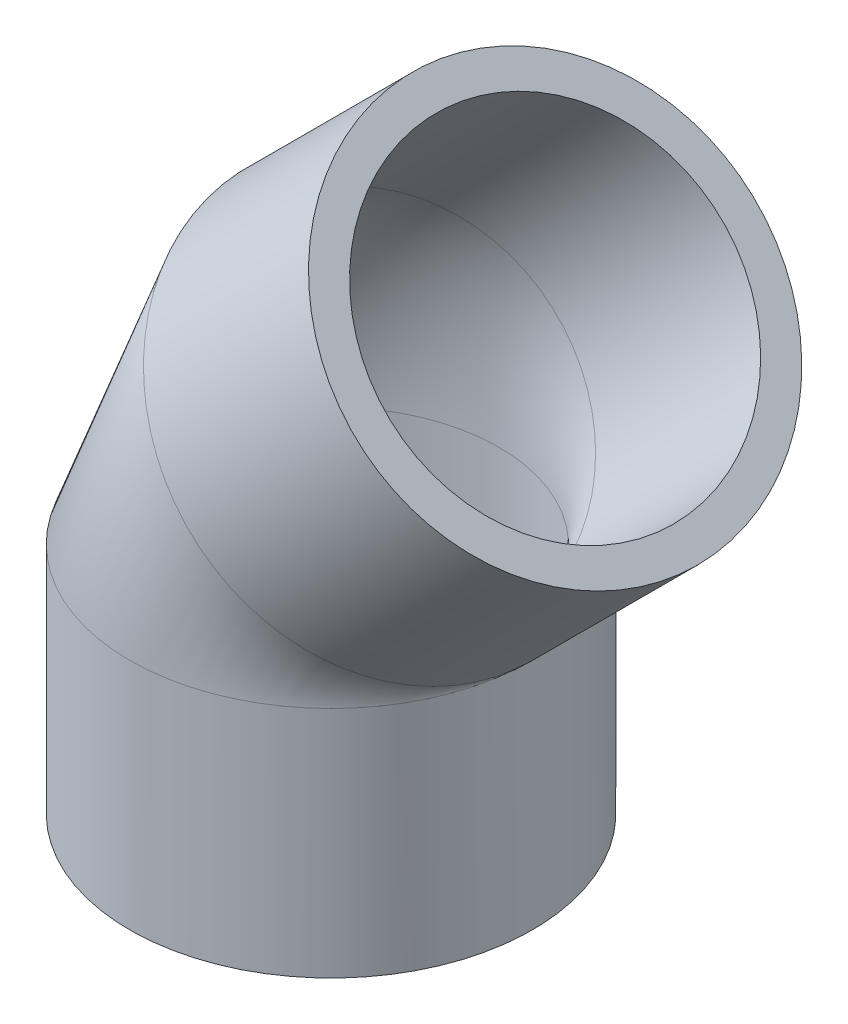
ISO-10303-21;
HEADER;
FILE_DESCRIPTION(('STEP AP214'),'2;1');
FILE_NAME('part.step','',(''),(''),'','','');
FILE_SCHEMA(('AUTOMOTIVE_DESIGN { 1 0 10303 214 1 1 1 1 }'));
ENDSEC;
DATA;
#1=APPLICATION_CONTEXT('core data for automotive mechanical design processes');
#2=APPLICATION_PROTOCOL_DEFINITION('international standard','automotive_design',2000,#1);
#3=PRODUCT_CONTEXT('',#1,'mechanical');
#4=PRODUCT('Part','Part','',(#3));
#5=PRODUCT_RELATED_PRODUCT_CATEGORY('part','',(#4));
#6=PRODUCT_DEFINITION_FORMATION('','',#4);
#7=PRODUCT_DEFINITION_CONTEXT('part definition',#1,'design');
#8=PRODUCT_DEFINITION('design','',#6,#7);
#9=PRODUCT_DEFINITION_SHAPE('','',#8);
#10=(LENGTH_UNIT() NAMED_UNIT(*) SI_UNIT(.MILLI.,.METRE.));
#11=(NAMED_UNIT(*) PLANE_ANGLE_UNIT() SI_UNIT($,.RADIAN.));
#12=(NAMED_UNIT(*) SI_UNIT($,.STERADIAN.) SOLID_ANGLE_UNIT());
#13=UNCERTAINTY_MEASURE_WITH_UNIT(LENGTH_MEASURE(1.E-05),#10,'distance_accuracy_value','');
#14=(GEOMETRIC_REPRESENTATION_CONTEXT(3) GLOBAL_UNCERTAINTY_ASSIGNED_CONTEXT((#13)) GLOBAL_UNIT_ASSIGNED_CONTEXT((#10,
#11,#12)) REPRESENTATION_CONTEXT('',''));
#15=CARTESIAN_POINT('',(0.,0.,0.));
#16=DIRECTION('',(0.,0.,1.));
#17=DIRECTION('',(1.,0.,0.));
#18=AXIS2_PLACEMENT_3D('',#15,#16,#17);
#19=CARTESIAN_POINT('',(30.48,35.3281743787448,0.));
#20=DIRECTION('',(0.,1.,0.));
#21=DIRECTION('',(-1.,0.,0.));
#22=AXIS2_PLACEMENT_3D('',#19,#20,#21);
#23=CYLINDRICAL_SURFACE('',#22,25.4);
#24=CARTESIAN_POINT('',(30.48,35.3281743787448,0.));
#25=DIRECTION('',(0.,-1.,0.));
#26=DIRECTION('',(1.,0.,0.));
#27=AXIS2_PLACEMENT_3D('',#24,#25,#26);
#28=CIRCLE('',#27,25.4);
#29=CARTESIAN_POINT('',(5.08,35.3281743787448,0.));
#30=VERTEX_POINT('',#29);
#31=EDGE_CURVE('E96',#30,#30,#28,.F.);
#32=ORIENTED_EDGE('',*,*,#31,.T.);
#33=EDGE_LOOP('',(#32));
#34=FACE_BOUND('',#33,.T.);
#35=CARTESIAN_POINT('',(30.48,0.,0.));
#36=DIRECTION('',(0.,1.,0.));
#37=DIRECTION('',(-1.,0.,0.));
#38=AXIS2_PLACEMENT_3D('',#35,#36,#37);
#39=CIRCLE('',#38,25.4);
#40=CARTESIAN_POINT('',(5.08,0.,0.));
#41=VERTEX_POINT('',#40);
#42=EDGE_CURVE('E99',#41,#41,#39,.T.);
#43=ORIENTED_EDGE('',*,*,#42,.F.);
#44=EDGE_LOOP('',(#43));
#45=FACE_BOUND('',#44,.T.);
#46=ADVANCED_FACE('F47',(#34,#45),#23,.F.);
#47=CARTESIAN_POINT('',(30.48,35.3281743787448,0.));
#48=DIRECTION('',(0.,1.,0.));
#49=DIRECTION('',(-1.,0.,0.));
#50=AXIS2_PLACEMENT_3D('',#47,#48,#49);
#51=CYLINDRICAL_SURFACE('',#50,30.48);
#52=CARTESIAN_POINT('',(30.48,35.3281743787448,0.));
#53=DIRECTION('',(0.,1.,0.));
#54=DIRECTION('',(-1.,0.,0.));
#55=AXIS2_PLACEMENT_3D('',#52,#53,#54);
#56=CIRCLE('',#55,30.48);
#57=CARTESIAN_POINT('',(60.96,35.3281743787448,0.));
#58=VERTEX_POINT('',#57);
#59=EDGE_CURVE('E11',#58,#58,#56,.T.);
#60=ORIENTED_EDGE('',*,*,#59,.F.);
#61=EDGE_LOOP('',(#60));
#62=FACE_BOUND('',#61,.T.);
#63=CARTESIAN_POINT('',(30.48,0.,0.));
#64=DIRECTION('',(0.,1.,0.));
#65=DIRECTION('',(-1.,0.,0.));
#66=AXIS2_PLACEMENT_3D('',#63,#64,#65);
#67=CIRCLE('',#66,30.48);
#68=CARTESIAN_POINT('',(0.,0.,0.));
#69=VERTEX_POINT('',#68);
#70=EDGE_CURVE('E55',#69,#69,#67,.T.);
#71=ORIENTED_EDGE('',*,*,#70,.T.);
#72=EDGE_LOOP('',(#71));
#73=FACE_BOUND('',#72,.T.);
#74=ADVANCED_FACE('F68',(#62,#73),#51,.T.);
#75=CARTESIAN_POINT('',(0.,0.,0.));
#76=DIRECTION('',(0.,-1.,0.));
#77=DIRECTION('',(1.,0.,0.));
#78=AXIS2_PLACEMENT_3D('',#75,#76,#77);
#79=PLANE('',#78);
#80=ORIENTED_EDGE('',*,*,#42,.T.);
#81=EDGE_LOOP('',(#80));
#82=FACE_BOUND('',#81,.T.);
#83=ORIENTED_EDGE('',*,*,#70,.F.);
#84=EDGE_LOOP('',(#83));
#85=FACE_BOUND('',#84,.T.);
#86=ADVANCED_FACE('F73',(#82,#85),#79,.T.);
#87=CARTESIAN_POINT('',(60.96,35.3281743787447,0.));
#88=DIRECTION('',(0.,0.,-1.));
#89=DIRECTION('',(-1.,0.,0.));
#90=AXIS2_PLACEMENT_3D('',#87,#88,#89);
#91=TOROIDAL_SURFACE('',#90,30.48,30.48);
#92=CARTESIAN_POINT('',(39.4073853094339,56.8807890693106,0.));
#93=DIRECTION('',(-0.707106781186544,-0.707106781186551,0.));
#94=DIRECTION('',(0.707106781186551,-0.707106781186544,0.));
#95=AXIS2_PLACEMENT_3D('',#92,#93,#94);
#96=CIRCLE('',#95,30.48);
#97=EDGE_CURVE('E59',#58,#58,#96,.T.);
#98=ORIENTED_EDGE('',*,*,#97,.T.);
#99=ORIENTED_EDGE('',*,*,#59,.T.);
#100=EDGE_LOOP('',(#98,#99));
#101=FACE_BOUND('',#100,.T.);
#102=ADVANCED_FACE('F70',(#101),#91,.T.);
#103=CARTESIAN_POINT('',(60.96,35.3281743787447,0.));
#104=DIRECTION('',(0.,0.,-1.));
#105=DIRECTION('',(-1.,0.,0.));
#106=AXIS2_PLACEMENT_3D('',#103,#104,#105);
#107=TOROIDAL_SURFACE('',#106,30.48,25.4);
#108=CARTESIAN_POINT('',(39.4073853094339,56.8807890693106,0.));
#109=DIRECTION('',(-0.707106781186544,-0.707106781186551,0.));
#110=DIRECTION('',(0.707106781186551,-0.707106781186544,0.));
#111=AXIS2_PLACEMENT_3D('',#108,#109,#110);
#112=CIRCLE('',#111,25.4);
#113=CARTESIAN_POINT('',(21.4468730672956,74.8413013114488,0.));
#114=VERTEX_POINT('',#113);
#115=EDGE_CURVE('E106',#114,#114,#112,.T.);
#116=CARTESIAN_POINT('',(60.96,35.3281743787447,0.));
#117=DIRECTION('',(0.,0.,-1.));
#118=DIRECTION('',(-1.,0.,0.));
#119=AXIS2_PLACEMENT_3D('',#116,#117,#118);
#120=CIRCLE('',#119,55.88);
#121=EDGE_CURVE('',#30,#114,#120,.T.);
#122=ORIENTED_EDGE('',*,*,#31,.F.);
#123=ORIENTED_EDGE('',*,*,#115,.F.);
#124=ORIENTED_EDGE('',*,*,#121,.T.);
#125=ORIENTED_EDGE('',*,*,#121,.F.);
#126=EDGE_LOOP('',(#122,#124,#123,#125));
#127=FACE_BOUND('',#126,.T.);
#128=ADVANCED_FACE('F72',(#127),#107,.F.);
#129=CARTESIAN_POINT('',(39.4073853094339,56.8807890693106,0.));
#130=DIRECTION('',(-0.707106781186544,-0.707106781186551,0.));
#131=DIRECTION('',(0.707106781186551,-0.707106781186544,0.));
#132=AXIS2_PLACEMENT_3D('',#129,#130,#131);
#133=CYLINDRICAL_SURFACE('',#132,25.4);
#134=CARTESIAN_POINT('',(64.3881770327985,81.8615807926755,0.));
#135=DIRECTION('',(-0.707106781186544,-0.707106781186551,0.));
#136=DIRECTION('',(0.707106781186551,-0.707106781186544,0.));
#137=AXIS2_PLACEMENT_3D('',#134,#135,#136);
#138=CIRCLE('',#137,25.4);
#139=CARTESIAN_POINT('',(82.3486892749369,63.9010685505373,0.));
#140=VERTEX_POINT('',#139);
#141=EDGE_CURVE('E114',#140,#140,#138,.T.);
#142=ORIENTED_EDGE('',*,*,#141,.F.);
#143=EDGE_LOOP('',(#142));
#144=FACE_BOUND('',#143,.T.);
#145=ORIENTED_EDGE('',*,*,#115,.T.);
#146=EDGE_LOOP('',(#145));
#147=FACE_BOUND('',#146,.T.);
#148=ADVANCED_FACE('F75',(#144,#147),#133,.F.);
#149=CARTESIAN_POINT('',(73.1248789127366,73.1248789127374,0.));
#150=DIRECTION('',(-0.707106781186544,-0.707106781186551,0.));
#151=DIRECTION('',(0.707106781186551,-0.707106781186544,0.));
#152=AXIS2_PLACEMENT_3D('',#149,#150,#151);
#153=PLANE('',#152);
#154=CARTESIAN_POINT('',(64.3881770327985,81.8615807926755,0.));
#155=DIRECTION('',(-0.707106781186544,-0.707106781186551,0.));
#156=DIRECTION('',(0.707106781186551,-0.707106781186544,0.));
#157=AXIS2_PLACEMENT_3D('',#154,#155,#156);
#158=CIRCLE('',#157,30.48);
#159=CARTESIAN_POINT('',(85.9407917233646,60.3089661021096,0.));
#160=VERTEX_POINT('',#159);
#161=EDGE_CURVE('E65',#160,#160,#158,.T.);
#162=ORIENTED_EDGE('',*,*,#161,.F.);
#163=EDGE_LOOP('',(#162));
#164=FACE_BOUND('',#163,.T.);
#165=ORIENTED_EDGE('',*,*,#141,.T.);
#166=EDGE_LOOP('',(#165));
#167=FACE_BOUND('',#166,.T.);
#168=ADVANCED_FACE('F86',(#164,#167),#153,.F.);
#169=CARTESIAN_POINT('',(39.4073853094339,56.8807890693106,0.));
#170=DIRECTION('',(-0.707106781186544,-0.707106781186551,0.));
#171=DIRECTION('',(0.707106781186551,-0.707106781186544,0.));
#172=AXIS2_PLACEMENT_3D('',#169,#170,#171);
#173=CYLINDRICAL_SURFACE('',#172,30.48);
#174=ORIENTED_EDGE('',*,*,#97,.F.);
#175=EDGE_LOOP('',(#174));
#176=FACE_BOUND('',#175,.T.);
#177=ORIENTED_EDGE('',*,*,#161,.T.);
#178=EDGE_LOOP('',(#177));
#179=FACE_BOUND('',#178,.T.);
#180=ADVANCED_FACE('F61',(#176,#179),#173,.T.);
#181=CLOSED_SHELL('',(#46,#74,#86,#102,#128,#148,#168,#180));
#182=MANIFOLD_SOLID_BREP('B2',#181);
#183=ADVANCED_BREP_SHAPE_REPRESENTATION('',(#18,#182),#14);
#184=SHAPE_DEFINITION_REPRESENTATION(#9,#183);
ENDSEC;
END-ISO-10303-21;
